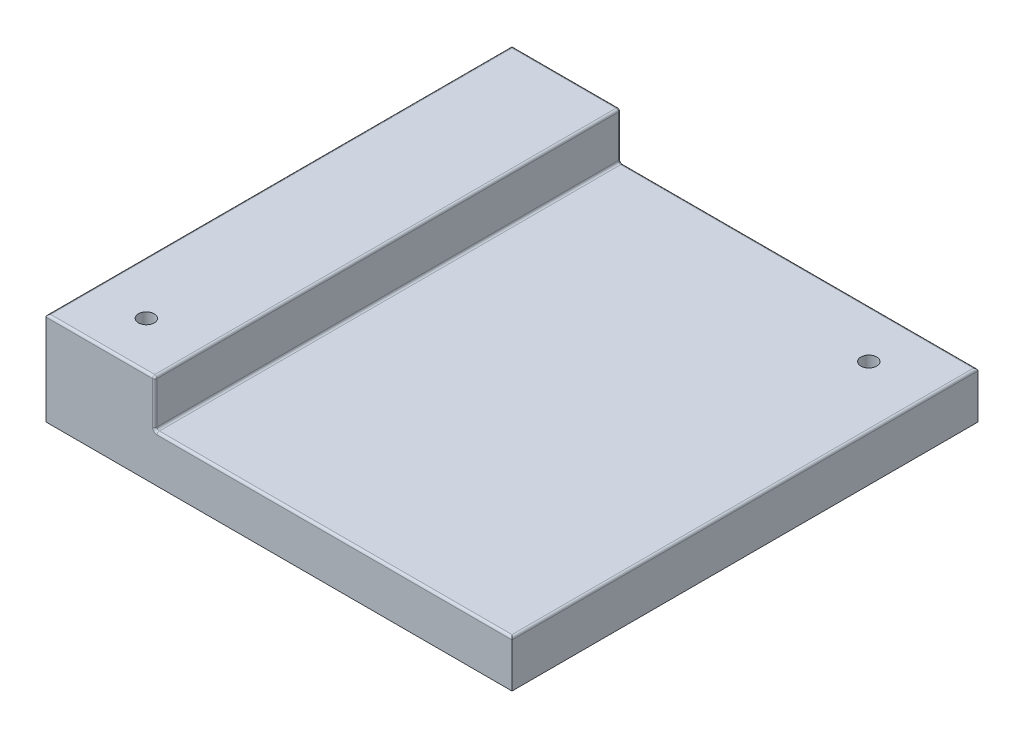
ISO-10303-21;
HEADER;
FILE_DESCRIPTION(('STEP AP214'),'2;1');
FILE_NAME('part.step','',(''),(''),'','','');
FILE_SCHEMA(('AUTOMOTIVE_DESIGN { 1 0 10303 214 1 1 1 1 }'));
ENDSEC;
DATA;
#1=APPLICATION_CONTEXT('core data for automotive mechanical design processes');
#2=APPLICATION_PROTOCOL_DEFINITION('international standard','automotive_design',2000,#1);
#3=PRODUCT_CONTEXT('',#1,'mechanical');
#4=PRODUCT('Part','Part','',(#3));
#5=PRODUCT_RELATED_PRODUCT_CATEGORY('part','',(#4));
#6=PRODUCT_DEFINITION_FORMATION('','',#4);
#7=PRODUCT_DEFINITION_CONTEXT('part definition',#1,'design');
#8=PRODUCT_DEFINITION('design','',#6,#7);
#9=PRODUCT_DEFINITION_SHAPE('','',#8);
#10=(LENGTH_UNIT() NAMED_UNIT(*) SI_UNIT(.MILLI.,.METRE.));
#11=(NAMED_UNIT(*) PLANE_ANGLE_UNIT() SI_UNIT($,.RADIAN.));
#12=(NAMED_UNIT(*) SI_UNIT($,.STERADIAN.) SOLID_ANGLE_UNIT());
#13=UNCERTAINTY_MEASURE_WITH_UNIT(LENGTH_MEASURE(1.E-05),#10,'distance_accuracy_value','');
#14=(GEOMETRIC_REPRESENTATION_CONTEXT(3) GLOBAL_UNCERTAINTY_ASSIGNED_CONTEXT((#13)) GLOBAL_UNIT_ASSIGNED_CONTEXT((#10,
#11,#12)) REPRESENTATION_CONTEXT('',''));
#15=CARTESIAN_POINT('',(0.,0.,0.));
#16=DIRECTION('',(0.,0.,1.));
#17=DIRECTION('',(1.,0.,0.));
#18=AXIS2_PLACEMENT_3D('',#15,#16,#17);
#19=CARTESIAN_POINT('',(1524.,0.,762.));
#20=DIRECTION('',(0.,1.,0.));
#21=DIRECTION('',(-1.,0.,0.));
#22=AXIS2_PLACEMENT_3D('',#19,#20,#21);
#23=PLANE('',#22);
#24=DIRECTION('',(1.,0.,0.));
#25=VECTOR('',#24,1.);
#26=CARTESIAN_POINT('',(1524.,0.,-762.));
#27=LINE('',#26,#25);
#28=CARTESIAN_POINT('',(0.,0.,-762.));
#29=VERTEX_POINT('',#28);
#30=CARTESIAN_POINT('',(1524.,0.,-762.));
#31=VERTEX_POINT('',#30);
#32=EDGE_CURVE('E248',#29,#31,#27,.T.);
#33=ORIENTED_EDGE('',*,*,#32,.T.);
#34=DIRECTION('',(0.,0.,-1.));
#35=VECTOR('',#34,1.);
#36=CARTESIAN_POINT('',(1524.,0.,762.));
#37=LINE('',#36,#35);
#38=CARTESIAN_POINT('',(1524.,0.,762.));
#39=VERTEX_POINT('',#38);
#40=EDGE_CURVE('E258',#39,#31,#37,.T.);
#41=ORIENTED_EDGE('',*,*,#40,.F.);
#42=DIRECTION('',(1.,0.,0.));
#43=VECTOR('',#42,1.);
#44=CARTESIAN_POINT('',(1524.,0.,762.));
#45=LINE('',#44,#43);
#46=CARTESIAN_POINT('',(0.,0.,762.));
#47=VERTEX_POINT('',#46);
#48=EDGE_CURVE('E238',#47,#39,#45,.T.);
#49=ORIENTED_EDGE('',*,*,#48,.F.);
#50=DIRECTION('',(0.,0.,-1.));
#51=VECTOR('',#50,1.);
#52=CARTESIAN_POINT('',(0.,0.,762.));
#53=LINE('',#52,#51);
#54=EDGE_CURVE('E247',#47,#29,#53,.T.);
#55=ORIENTED_EDGE('',*,*,#54,.T.);
#56=EDGE_LOOP('',(#33,#41,#49,#55));
#57=FACE_BOUND('',#56,.T.);
#58=DIRECTION('',(1.,0.,0.));
#59=VECTOR('',#58,1.);
#60=CARTESIAN_POINT('',(0.,0.,-723.9));
#61=LINE('',#60,#59);
#62=CARTESIAN_POINT('',(38.1,0.,-723.9));
#63=VERTEX_POINT('',#62);
#64=CARTESIAN_POINT('',(1485.9,0.,-723.9));
#65=VERTEX_POINT('',#64);
#66=EDGE_CURVE('E191',#63,#65,#61,.T.);
#67=ORIENTED_EDGE('',*,*,#66,.F.);
#68=DIRECTION('',(0.,0.,-1.));
#69=VECTOR('',#68,1.);
#70=CARTESIAN_POINT('',(38.1,0.,762.));
#71=LINE('',#70,#69);
#72=CARTESIAN_POINT('',(38.1,0.,723.9));
#73=VERTEX_POINT('',#72);
#74=EDGE_CURVE('E218',#73,#63,#71,.T.);
#75=ORIENTED_EDGE('',*,*,#74,.F.);
#76=DIRECTION('',(1.,0.,0.));
#77=VECTOR('',#76,1.);
#78=CARTESIAN_POINT('',(0.,0.,723.9));
#79=LINE('',#78,#77);
#80=CARTESIAN_POINT('',(1485.9,0.,723.9));
#81=VERTEX_POINT('',#80);
#82=EDGE_CURVE('E47',#73,#81,#79,.T.);
#83=ORIENTED_EDGE('',*,*,#82,.T.);
#84=DIRECTION('',(0.,0.,-1.));
#85=VECTOR('',#84,1.);
#86=CARTESIAN_POINT('',(1485.9,0.,762.));
#87=LINE('',#86,#85);
#88=EDGE_CURVE('E209',#81,#65,#87,.T.);
#89=ORIENTED_EDGE('',*,*,#88,.T.);
#90=EDGE_LOOP('',(#67,#75,#83,#89));
#91=FACE_BOUND('',#90,.T.);
#92=ADVANCED_FACE('F30',(#57,#91),#23,.F.);
#93=CARTESIAN_POINT('',(1524.,152.4,762.));
#94=DIRECTION('',(-1.,0.,0.));
#95=DIRECTION('',(0.,0.,1.));
#96=AXIS2_PLACEMENT_3D('',#93,#94,#95);
#97=PLANE('',#96);
#98=DIRECTION('',(0.,1.,0.));
#99=VECTOR('',#98,1.);
#100=CARTESIAN_POINT('',(1524.,152.4,-762.));
#101=LINE('',#100,#99);
#102=CARTESIAN_POINT('',(1524.,144.78,-762.));
#103=VERTEX_POINT('',#102);
#104=EDGE_CURVE('E251',#31,#103,#101,.T.);
#105=ORIENTED_EDGE('',*,*,#104,.T.);
#106=DIRECTION('',(0.,0.,-1.));
#107=VECTOR('',#106,1.);
#108=CARTESIAN_POINT('',(1524.,144.78,762.));
#109=LINE('',#108,#107);
#110=CARTESIAN_POINT('',(1524.,144.78,762.));
#111=VERTEX_POINT('',#110);
#112=EDGE_CURVE('E270',#103,#111,#109,.F.);
#113=ORIENTED_EDGE('',*,*,#112,.T.);
#114=DIRECTION('',(0.,1.,0.));
#115=VECTOR('',#114,1.);
#116=CARTESIAN_POINT('',(1524.,152.4,762.));
#117=LINE('',#116,#115);
#118=EDGE_CURVE('E241',#39,#111,#117,.T.);
#119=ORIENTED_EDGE('',*,*,#118,.F.);
#120=ORIENTED_EDGE('',*,*,#40,.T.);
#121=EDGE_LOOP('',(#105,#113,#119,#120));
#122=FACE_BOUND('',#121,.T.);
#123=ADVANCED_FACE('F376',(#122),#97,.F.);
#124=CARTESIAN_POINT('',(355.6,152.4,762.));
#125=DIRECTION('',(0.,-1.,0.));
#126=DIRECTION('',(0.,0.,-1.));
#127=AXIS2_PLACEMENT_3D('',#124,#125,#126);
#128=PLANE('',#127);
#129=CARTESIAN_POINT('',(1326.49600251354,152.4,-602.31280623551));
#130=DIRECTION('',(0.,-1.,0.));
#131=DIRECTION('',(0.,0.,-1.));
#132=AXIS2_PLACEMENT_3D('',#129,#130,#131);
#133=CIRCLE('',#132,25.8977072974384);
#134=CARTESIAN_POINT('',(1326.49600251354,152.4,-576.415098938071));
#135=VERTEX_POINT('',#134);
#136=EDGE_CURVE('E351',#135,#135,#133,.T.);
#137=ORIENTED_EDGE('',*,*,#136,.T.);
#138=EDGE_LOOP('',(#137));
#139=FACE_BOUND('',#138,.T.);
#140=DIRECTION('',(-1.,0.,0.));
#141=VECTOR('',#140,1.);
#142=CARTESIAN_POINT('',(355.6,152.4,754.38));
#143=LINE('',#142,#141);
#144=CARTESIAN_POINT('',(363.22,152.4,754.38));
#145=VERTEX_POINT('',#144);
#146=CARTESIAN_POINT('',(1516.38,152.4,754.38));
#147=VERTEX_POINT('',#146);
#148=EDGE_CURVE('E265',#145,#147,#143,.F.);
#149=ORIENTED_EDGE('',*,*,#148,.T.);
#150=DIRECTION('',(0.,0.,-1.));
#151=VECTOR('',#150,1.);
#152=CARTESIAN_POINT('',(1516.38,152.4,762.));
#153=LINE('',#152,#151);
#154=CARTESIAN_POINT('',(1516.38,152.4,-754.38));
#155=VERTEX_POINT('',#154);
#156=EDGE_CURVE('E267',#147,#155,#153,.T.);
#157=ORIENTED_EDGE('',*,*,#156,.T.);
#158=DIRECTION('',(-1.,0.,0.));
#159=VECTOR('',#158,1.);
#160=CARTESIAN_POINT('',(355.6,152.4,-754.38));
#161=LINE('',#160,#159);
#162=CARTESIAN_POINT('',(363.22,152.4,-754.38));
#163=VERTEX_POINT('',#162);
#164=EDGE_CURVE('E263',#155,#163,#161,.T.);
#165=ORIENTED_EDGE('',*,*,#164,.T.);
#166=DIRECTION('',(0.,0.,-1.));
#167=VECTOR('',#166,1.);
#168=CARTESIAN_POINT('',(363.22,152.4,762.));
#169=LINE('',#168,#167);
#170=EDGE_CURVE('E261',#163,#145,#169,.F.);
#171=ORIENTED_EDGE('',*,*,#170,.T.);
#172=EDGE_LOOP('',(#149,#157,#165,#171));
#173=FACE_BOUND('',#172,.T.);
#174=ADVANCED_FACE('F382',(#139,#173),#128,.F.);
#175=CARTESIAN_POINT('',(355.6,304.8,762.));
#176=DIRECTION('',(-1.,0.,0.));
#177=DIRECTION('',(0.,0.,1.));
#178=AXIS2_PLACEMENT_3D('',#175,#176,#177);
#179=PLANE('',#178);
#180=DIRECTION('',(0.,1.,0.));
#181=VECTOR('',#180,1.);
#182=CARTESIAN_POINT('',(355.6,304.8,754.38));
#183=LINE('',#182,#181);
#184=CARTESIAN_POINT('',(355.6,297.18,754.38));
#185=VERTEX_POINT('',#184);
#186=CARTESIAN_POINT('',(355.6,160.02,754.38));
#187=VERTEX_POINT('',#186);
#188=EDGE_CURVE('E295',#185,#187,#183,.F.);
#189=ORIENTED_EDGE('',*,*,#188,.T.);
#190=DIRECTION('',(0.,0.,-1.));
#191=VECTOR('',#190,1.);
#192=CARTESIAN_POINT('',(355.6,160.02,-762.));
#193=LINE('',#192,#191);
#194=CARTESIAN_POINT('',(355.6,160.02,-754.38));
#195=VERTEX_POINT('',#194);
#196=EDGE_CURVE('E297',#187,#195,#193,.T.);
#197=ORIENTED_EDGE('',*,*,#196,.T.);
#198=DIRECTION('',(0.,1.,0.));
#199=VECTOR('',#198,1.);
#200=CARTESIAN_POINT('',(355.6,304.8,-754.38));
#201=LINE('',#200,#199);
#202=CARTESIAN_POINT('',(355.6,297.18,-754.38));
#203=VERTEX_POINT('',#202);
#204=EDGE_CURVE('E293',#195,#203,#201,.T.);
#205=ORIENTED_EDGE('',*,*,#204,.T.);
#206=DIRECTION('',(0.,0.,-1.));
#207=VECTOR('',#206,1.);
#208=CARTESIAN_POINT('',(355.6,297.18,762.));
#209=LINE('',#208,#207);
#210=EDGE_CURVE('E291',#203,#185,#209,.F.);
#211=ORIENTED_EDGE('',*,*,#210,.T.);
#212=EDGE_LOOP('',(#189,#197,#205,#211));
#213=FACE_BOUND('',#212,.T.);
#214=ADVANCED_FACE('F473',(#213),#179,.F.);
#215=CARTESIAN_POINT('',(0.,304.8,762.));
#216=DIRECTION('',(0.,-1.,0.));
#217=DIRECTION('',(0.,0.,-1.));
#218=AXIS2_PLACEMENT_3D('',#215,#216,#217);
#219=PLANE('',#218);
#220=CARTESIAN_POINT('',(175.248210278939,304.8,609.021753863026));
#221=DIRECTION('',(0.,1.,0.));
#222=DIRECTION('',(0.,0.,1.));
#223=AXIS2_PLACEMENT_3D('',#220,#221,#222);
#224=CIRCLE('',#223,25.8977072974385);
#225=CARTESIAN_POINT('',(175.248210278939,304.8,634.919461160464));
#226=VERTEX_POINT('',#225);
#227=EDGE_CURVE('E199',#226,#226,#224,.T.);
#228=ORIENTED_EDGE('',*,*,#227,.F.);
#229=EDGE_LOOP('',(#228));
#230=FACE_BOUND('',#229,.T.);
#231=DIRECTION('',(-1.,0.,0.));
#232=VECTOR('',#231,1.);
#233=CARTESIAN_POINT('',(0.,304.8,754.38));
#234=LINE('',#233,#232);
#235=CARTESIAN_POINT('',(7.62,304.8,754.38));
#236=VERTEX_POINT('',#235);
#237=CARTESIAN_POINT('',(347.98,304.8,754.38));
#238=VERTEX_POINT('',#237);
#239=EDGE_CURVE('E55',#236,#238,#234,.F.);
#240=ORIENTED_EDGE('',*,*,#239,.T.);
#241=DIRECTION('',(0.,0.,-1.));
#242=VECTOR('',#241,1.);
#243=CARTESIAN_POINT('',(347.98,304.8,762.));
#244=LINE('',#243,#242);
#245=CARTESIAN_POINT('',(347.98,304.8,-754.38));
#246=VERTEX_POINT('',#245);
#247=EDGE_CURVE('E39',#238,#246,#244,.T.);
#248=ORIENTED_EDGE('',*,*,#247,.T.);
#249=DIRECTION('',(-1.,0.,0.));
#250=VECTOR('',#249,1.);
#251=CARTESIAN_POINT('',(0.,304.8,-754.38));
#252=LINE('',#251,#250);
#253=CARTESIAN_POINT('',(7.62,304.8,-754.38));
#254=VERTEX_POINT('',#253);
#255=EDGE_CURVE('E300',#246,#254,#252,.T.);
#256=ORIENTED_EDGE('',*,*,#255,.T.);
#257=DIRECTION('',(0.,0.,-1.));
#258=VECTOR('',#257,1.);
#259=CARTESIAN_POINT('',(7.62,304.8,762.));
#260=LINE('',#259,#258);
#261=EDGE_CURVE('E302',#254,#236,#260,.F.);
#262=ORIENTED_EDGE('',*,*,#261,.T.);
#263=EDGE_LOOP('',(#240,#248,#256,#262));
#264=FACE_BOUND('',#263,.T.);
#265=ADVANCED_FACE('F478',(#230,#264),#219,.F.);
#266=CARTESIAN_POINT('',(0.,0.,762.));
#267=DIRECTION('',(1.,0.,0.));
#268=DIRECTION('',(0.,0.,-1.));
#269=AXIS2_PLACEMENT_3D('',#266,#267,#268);
#270=PLANE('',#269);
#271=DIRECTION('',(0.,-1.,0.));
#272=VECTOR('',#271,1.);
#273=CARTESIAN_POINT('',(0.,0.,762.));
#274=LINE('',#273,#272);
#275=CARTESIAN_POINT('',(0.,297.18,762.));
#276=VERTEX_POINT('',#275);
#277=EDGE_CURVE('E245',#276,#47,#274,.T.);
#278=ORIENTED_EDGE('',*,*,#277,.F.);
#279=DIRECTION('',(0.,0.,-1.));
#280=VECTOR('',#279,1.);
#281=CARTESIAN_POINT('',(0.,297.18,762.));
#282=LINE('',#281,#280);
#283=CARTESIAN_POINT('',(0.,297.18,-762.));
#284=VERTEX_POINT('',#283);
#285=EDGE_CURVE('E11',#276,#284,#282,.T.);
#286=ORIENTED_EDGE('',*,*,#285,.T.);
#287=DIRECTION('',(0.,-1.,0.));
#288=VECTOR('',#287,1.);
#289=CARTESIAN_POINT('',(0.,0.,-762.));
#290=LINE('',#289,#288);
#291=EDGE_CURVE('E242',#284,#29,#290,.T.);
#292=ORIENTED_EDGE('',*,*,#291,.T.);
#293=ORIENTED_EDGE('',*,*,#54,.F.);
#294=EDGE_LOOP('',(#278,#286,#292,#293));
#295=FACE_BOUND('',#294,.T.);
#296=ADVANCED_FACE('F452',(#295),#270,.F.);
#297=CARTESIAN_POINT('',(0.,0.,762.));
#298=DIRECTION('',(0.,0.,-1.));
#299=DIRECTION('',(-1.,0.,0.));
#300=AXIS2_PLACEMENT_3D('',#297,#298,#299);
#301=PLANE('',#300);
#302=ORIENTED_EDGE('',*,*,#118,.T.);
#303=DIRECTION('',(-1.,0.,0.));
#304=VECTOR('',#303,1.);
#305=CARTESIAN_POINT('',(0.,144.78,762.));
#306=LINE('',#305,#304);
#307=CARTESIAN_POINT('',(363.22,144.78,762.));
#308=VERTEX_POINT('',#307);
#309=EDGE_CURVE('E280',#111,#308,#306,.T.);
#310=ORIENTED_EDGE('',*,*,#309,.T.);
#311=CARTESIAN_POINT('',(363.22,160.02,762.));
#312=DIRECTION('',(0.,0.,-1.));
#313=DIRECTION('',(-1.,0.,0.));
#314=AXIS2_PLACEMENT_3D('',#311,#312,#313);
#315=CIRCLE('',#314,15.24);
#316=CARTESIAN_POINT('',(347.98,160.02,762.));
#317=VERTEX_POINT('',#316);
#318=EDGE_CURVE('E277',#317,#308,#315,.F.);
#319=ORIENTED_EDGE('',*,*,#318,.F.);
#320=DIRECTION('',(0.,1.,0.));
#321=VECTOR('',#320,1.);
#322=CARTESIAN_POINT('',(347.98,0.,762.));
#323=LINE('',#322,#321);
#324=CARTESIAN_POINT('',(347.98,297.18,762.));
#325=VERTEX_POINT('',#324);
#326=EDGE_CURVE('E275',#317,#325,#323,.T.);
#327=ORIENTED_EDGE('',*,*,#326,.T.);
#328=DIRECTION('',(-1.,0.,0.));
#329=VECTOR('',#328,1.);
#330=CARTESIAN_POINT('',(0.,297.18,762.));
#331=LINE('',#330,#329);
#332=EDGE_CURVE('E273',#325,#276,#331,.T.);
#333=ORIENTED_EDGE('',*,*,#332,.T.);
#334=ORIENTED_EDGE('',*,*,#277,.T.);
#335=ORIENTED_EDGE('',*,*,#48,.T.);
#336=EDGE_LOOP('',(#302,#310,#319,#327,#333,#334,#335));
#337=FACE_BOUND('',#336,.T.);
#338=ADVANCED_FACE('F460',(#337),#301,.F.);
#339=CARTESIAN_POINT('',(0.,0.,-762.));
#340=DIRECTION('',(0.,0.,-1.));
#341=DIRECTION('',(-1.,0.,0.));
#342=AXIS2_PLACEMENT_3D('',#339,#340,#341);
#343=PLANE('',#342);
#344=CARTESIAN_POINT('',(363.22,160.02,-762.));
#345=DIRECTION('',(0.,0.,-1.));
#346=DIRECTION('',(-1.,0.,0.));
#347=AXIS2_PLACEMENT_3D('',#344,#345,#346);
#348=CIRCLE('',#347,15.24);
#349=CARTESIAN_POINT('',(363.22,144.78,-762.));
#350=VERTEX_POINT('',#349);
#351=CARTESIAN_POINT('',(347.98,160.02,-762.));
#352=VERTEX_POINT('',#351);
#353=EDGE_CURVE('E286',#350,#352,#348,.T.);
#354=ORIENTED_EDGE('',*,*,#353,.F.);
#355=DIRECTION('',(-1.,0.,0.));
#356=VECTOR('',#355,1.);
#357=CARTESIAN_POINT('',(1524.,144.78,-762.));
#358=LINE('',#357,#356);
#359=EDGE_CURVE('E289',#350,#103,#358,.F.);
#360=ORIENTED_EDGE('',*,*,#359,.T.);
#361=ORIENTED_EDGE('',*,*,#104,.F.);
#362=ORIENTED_EDGE('',*,*,#32,.F.);
#363=ORIENTED_EDGE('',*,*,#291,.F.);
#364=DIRECTION('',(-1.,0.,0.));
#365=VECTOR('',#364,1.);
#366=CARTESIAN_POINT('',(355.6,297.18,-762.));
#367=LINE('',#366,#365);
#368=CARTESIAN_POINT('',(347.98,297.18,-762.));
#369=VERTEX_POINT('',#368);
#370=EDGE_CURVE('E282',#284,#369,#367,.F.);
#371=ORIENTED_EDGE('',*,*,#370,.T.);
#372=DIRECTION('',(0.,1.,0.));
#373=VECTOR('',#372,1.);
#374=CARTESIAN_POINT('',(347.98,152.4,-762.));
#375=LINE('',#374,#373);
#376=EDGE_CURVE('E284',#369,#352,#375,.F.);
#377=ORIENTED_EDGE('',*,*,#376,.T.);
#378=EDGE_LOOP('',(#354,#360,#361,#362,#363,#371,#377));
#379=FACE_BOUND('',#378,.T.);
#380=ADVANCED_FACE('F440',(#379),#343,.T.);
#381=CARTESIAN_POINT('',(7.62,297.18,762.));
#382=DIRECTION('',(0.,0.,-1.));
#383=DIRECTION('',(-1.,0.,0.));
#384=AXIS2_PLACEMENT_3D('',#381,#382,#383);
#385=CYLINDRICAL_SURFACE('',#384,7.62);
#386=CARTESIAN_POINT('',(7.62,297.18,-754.38));
#387=DIRECTION('',(0.707106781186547,0.,-0.707106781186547));
#388=DIRECTION('',(0.707106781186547,0.,0.707106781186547));
#389=AXIS2_PLACEMENT_3D('',#386,#387,#388);
#390=ELLIPSE('',#389,10.776307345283,7.62);
#391=EDGE_CURVE('E343',#284,#254,#390,.T.);
#392=ORIENTED_EDGE('',*,*,#391,.F.);
#393=ORIENTED_EDGE('',*,*,#285,.F.);
#394=CARTESIAN_POINT('',(7.62,297.18,754.38));
#395=DIRECTION('',(-0.707106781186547,0.,-0.707106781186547));
#396=DIRECTION('',(0.707106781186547,0.,-0.707106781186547));
#397=AXIS2_PLACEMENT_3D('',#394,#395,#396);
#398=ELLIPSE('',#397,10.776307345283,7.62);
#399=EDGE_CURVE('E252',#236,#276,#398,.F.);
#400=ORIENTED_EDGE('',*,*,#399,.F.);
#401=ORIENTED_EDGE('',*,*,#261,.F.);
#402=EDGE_LOOP('',(#392,#393,#400,#401));
#403=FACE_BOUND('',#402,.T.);
#404=ADVANCED_FACE('F32',(#403),#385,.T.);
#405=CARTESIAN_POINT('',(0.,297.18,754.38));
#406=DIRECTION('',(-1.,0.,0.));
#407=DIRECTION('',(0.,0.,1.));
#408=AXIS2_PLACEMENT_3D('',#405,#406,#407);
#409=CYLINDRICAL_SURFACE('',#408,7.62);
#410=ORIENTED_EDGE('',*,*,#399,.T.);
#411=ORIENTED_EDGE('',*,*,#332,.F.);
#412=CARTESIAN_POINT('',(347.98,297.18,754.38));
#413=DIRECTION('',(1.,0.,0.));
#414=DIRECTION('',(0.,0.,-1.));
#415=AXIS2_PLACEMENT_3D('',#412,#413,#414);
#416=CIRCLE('',#415,7.62);
#417=EDGE_CURVE('E340',#238,#325,#416,.T.);
#418=ORIENTED_EDGE('',*,*,#417,.F.);
#419=ORIENTED_EDGE('',*,*,#239,.F.);
#420=EDGE_LOOP('',(#410,#411,#418,#419));
#421=FACE_BOUND('',#420,.T.);
#422=ADVANCED_FACE('F433',(#421),#409,.T.);
#423=CARTESIAN_POINT('',(347.98,297.18,762.));
#424=DIRECTION('',(0.,0.,-1.));
#425=DIRECTION('',(-1.,0.,0.));
#426=AXIS2_PLACEMENT_3D('',#423,#424,#425);
#427=CYLINDRICAL_SURFACE('',#426,7.62);
#428=CARTESIAN_POINT('',(347.98,297.18,-754.38));
#429=DIRECTION('',(0.,0.,-1.));
#430=DIRECTION('',(-1.,0.,0.));
#431=AXIS2_PLACEMENT_3D('',#428,#429,#430);
#432=CIRCLE('',#431,7.62);
#433=EDGE_CURVE('E334',#246,#203,#432,.T.);
#434=ORIENTED_EDGE('',*,*,#433,.F.);
#435=ORIENTED_EDGE('',*,*,#247,.F.);
#436=CARTESIAN_POINT('',(347.98,297.18,754.38));
#437=DIRECTION('',(0.,0.,1.));
#438=DIRECTION('',(1.,0.,0.));
#439=AXIS2_PLACEMENT_3D('',#436,#437,#438);
#440=CIRCLE('',#439,7.62);
#441=EDGE_CURVE('E337',#185,#238,#440,.T.);
#442=ORIENTED_EDGE('',*,*,#441,.F.);
#443=ORIENTED_EDGE('',*,*,#210,.F.);
#444=EDGE_LOOP('',(#434,#435,#442,#443));
#445=FACE_BOUND('',#444,.T.);
#446=ADVANCED_FACE('F430',(#445),#427,.T.);
#447=CARTESIAN_POINT('',(0.,297.18,-754.38));
#448=DIRECTION('',(1.,0.,0.));
#449=DIRECTION('',(0.,0.,-1.));
#450=AXIS2_PLACEMENT_3D('',#447,#448,#449);
#451=CYLINDRICAL_SURFACE('',#450,7.62);
#452=ORIENTED_EDGE('',*,*,#391,.T.);
#453=ORIENTED_EDGE('',*,*,#255,.F.);
#454=CARTESIAN_POINT('',(347.98,297.18,-754.38));
#455=DIRECTION('',(1.,0.,0.));
#456=DIRECTION('',(0.,0.,-1.));
#457=AXIS2_PLACEMENT_3D('',#454,#455,#456);
#458=CIRCLE('',#457,7.62);
#459=EDGE_CURVE('E332',#369,#246,#458,.T.);
#460=ORIENTED_EDGE('',*,*,#459,.F.);
#461=ORIENTED_EDGE('',*,*,#370,.F.);
#462=EDGE_LOOP('',(#452,#453,#460,#461));
#463=FACE_BOUND('',#462,.T.);
#464=ADVANCED_FACE('F426',(#463),#451,.T.);
#465=CARTESIAN_POINT('',(347.98,297.18,754.38));
#466=DIRECTION('',(0.,0.,1.));
#467=DIRECTION('',(1.,0.,0.));
#468=AXIS2_PLACEMENT_3D('',#465,#466,#467);
#469=SPHERICAL_SURFACE('',#468,7.62);
#470=ORIENTED_EDGE('',*,*,#441,.T.);
#471=ORIENTED_EDGE('',*,*,#417,.T.);
#472=CARTESIAN_POINT('',(347.98,297.18,754.38));
#473=DIRECTION('',(0.,1.,0.));
#474=DIRECTION('',(0.,0.,1.));
#475=AXIS2_PLACEMENT_3D('',#472,#473,#474);
#476=CIRCLE('',#475,7.62);
#477=EDGE_CURVE('E329',#185,#325,#476,.F.);
#478=ORIENTED_EDGE('',*,*,#477,.F.);
#479=EDGE_LOOP('',(#470,#471,#478));
#480=FACE_BOUND('',#479,.T.);
#481=ADVANCED_FACE('F422',(#480),#469,.T.);
#482=CARTESIAN_POINT('',(347.98,297.18,-754.38));
#483=DIRECTION('',(0.,0.,1.));
#484=DIRECTION('',(1.,0.,0.));
#485=AXIS2_PLACEMENT_3D('',#482,#483,#484);
#486=SPHERICAL_SURFACE('',#485,7.62);
#487=ORIENTED_EDGE('',*,*,#459,.T.);
#488=ORIENTED_EDGE('',*,*,#433,.T.);
#489=CARTESIAN_POINT('',(347.98,297.18,-754.38));
#490=DIRECTION('',(0.,1.,0.));
#491=DIRECTION('',(0.,0.,1.));
#492=AXIS2_PLACEMENT_3D('',#489,#490,#491);
#493=CIRCLE('',#492,7.62);
#494=EDGE_CURVE('E326',#369,#203,#493,.F.);
#495=ORIENTED_EDGE('',*,*,#494,.F.);
#496=EDGE_LOOP('',(#487,#488,#495));
#497=FACE_BOUND('',#496,.T.);
#498=ADVANCED_FACE('F418',(#497),#486,.T.);
#499=CARTESIAN_POINT('',(347.98,0.,754.38));
#500=DIRECTION('',(0.,1.,0.));
#501=DIRECTION('',(0.,0.,1.));
#502=AXIS2_PLACEMENT_3D('',#499,#500,#501);
#503=CYLINDRICAL_SURFACE('',#502,7.62);
#504=ORIENTED_EDGE('',*,*,#477,.T.);
#505=ORIENTED_EDGE('',*,*,#326,.F.);
#506=CARTESIAN_POINT('',(347.98,160.02,754.38));
#507=DIRECTION('',(0.,-1.,0.));
#508=DIRECTION('',(0.,0.,-1.));
#509=AXIS2_PLACEMENT_3D('',#506,#507,#508);
#510=CIRCLE('',#509,7.62);
#511=EDGE_CURVE('E323',#187,#317,#510,.T.);
#512=ORIENTED_EDGE('',*,*,#511,.F.);
#513=ORIENTED_EDGE('',*,*,#188,.F.);
#514=EDGE_LOOP('',(#504,#505,#512,#513));
#515=FACE_BOUND('',#514,.T.);
#516=ADVANCED_FACE('F414',(#515),#503,.T.);
#517=CARTESIAN_POINT('',(363.22,160.02,762.));
#518=DIRECTION('',(0.,0.,1.));
#519=DIRECTION('',(1.,0.,0.));
#520=AXIS2_PLACEMENT_3D('',#517,#518,#519);
#521=CYLINDRICAL_SURFACE('',#520,7.62);
#522=CARTESIAN_POINT('',(363.22,160.02,-754.38));
#523=DIRECTION('',(0.,0.,-1.));
#524=DIRECTION('',(-1.,0.,0.));
#525=AXIS2_PLACEMENT_3D('',#522,#523,#524);
#526=CIRCLE('',#525,7.62);
#527=EDGE_CURVE('E317',#195,#163,#526,.F.);
#528=ORIENTED_EDGE('',*,*,#527,.F.);
#529=ORIENTED_EDGE('',*,*,#196,.F.);
#530=CARTESIAN_POINT('',(363.22,160.02,754.38));
#531=DIRECTION('',(0.,0.,-1.));
#532=DIRECTION('',(-1.,0.,0.));
#533=AXIS2_PLACEMENT_3D('',#530,#531,#532);
#534=CIRCLE('',#533,7.62);
#535=EDGE_CURVE('E320',#145,#187,#534,.T.);
#536=ORIENTED_EDGE('',*,*,#535,.F.);
#537=ORIENTED_EDGE('',*,*,#170,.F.);
#538=EDGE_LOOP('',(#528,#529,#536,#537));
#539=FACE_BOUND('',#538,.T.);
#540=ADVANCED_FACE('F410',(#539),#521,.F.);
#541=CARTESIAN_POINT('',(347.98,304.8,-754.38));
#542=DIRECTION('',(0.,-1.,0.));
#543=DIRECTION('',(0.,0.,-1.));
#544=AXIS2_PLACEMENT_3D('',#541,#542,#543);
#545=CYLINDRICAL_SURFACE('',#544,7.62);
#546=ORIENTED_EDGE('',*,*,#494,.T.);
#547=ORIENTED_EDGE('',*,*,#204,.F.);
#548=CARTESIAN_POINT('',(347.98,160.02,-754.38));
#549=DIRECTION('',(0.,-1.,0.));
#550=DIRECTION('',(0.,0.,-1.));
#551=AXIS2_PLACEMENT_3D('',#548,#549,#550);
#552=CIRCLE('',#551,7.62);
#553=EDGE_CURVE('E315',#352,#195,#552,.T.);
#554=ORIENTED_EDGE('',*,*,#553,.F.);
#555=ORIENTED_EDGE('',*,*,#376,.F.);
#556=EDGE_LOOP('',(#546,#547,#554,#555));
#557=FACE_BOUND('',#556,.T.);
#558=ADVANCED_FACE('F406',(#557),#545,.T.);
#559=CARTESIAN_POINT('',(363.22,160.02,754.38));
#560=DIRECTION('',(0.,0.,-1.));
#561=DIRECTION('',(-1.,0.,0.));
#562=AXIS2_PLACEMENT_3D('',#559,#560,#561);
#563=TOROIDAL_SURFACE('',#562,15.24,7.62);
#564=ORIENTED_EDGE('',*,*,#511,.T.);
#565=ORIENTED_EDGE('',*,*,#318,.T.);
#566=CARTESIAN_POINT('',(363.22,144.78,754.38));
#567=DIRECTION('',(-1.,0.,0.));
#568=DIRECTION('',(0.,0.,1.));
#569=AXIS2_PLACEMENT_3D('',#566,#567,#568);
#570=CIRCLE('',#569,7.62);
#571=EDGE_CURVE('E312',#145,#308,#570,.F.);
#572=ORIENTED_EDGE('',*,*,#571,.F.);
#573=ORIENTED_EDGE('',*,*,#535,.T.);
#574=EDGE_LOOP('',(#564,#565,#572,#573));
#575=FACE_BOUND('',#574,.T.);
#576=ADVANCED_FACE('F402',(#575),#563,.T.);
#577=CARTESIAN_POINT('',(363.22,160.02,-754.38));
#578=DIRECTION('',(0.,0.,-1.));
#579=DIRECTION('',(-1.,0.,0.));
#580=AXIS2_PLACEMENT_3D('',#577,#578,#579);
#581=TOROIDAL_SURFACE('',#580,15.24,7.62);
#582=ORIENTED_EDGE('',*,*,#553,.T.);
#583=ORIENTED_EDGE('',*,*,#527,.T.);
#584=CARTESIAN_POINT('',(363.22,144.78,-754.38));
#585=DIRECTION('',(-1.,0.,0.));
#586=DIRECTION('',(0.,0.,1.));
#587=AXIS2_PLACEMENT_3D('',#584,#585,#586);
#588=CIRCLE('',#587,7.62);
#589=EDGE_CURVE('E309',#350,#163,#588,.F.);
#590=ORIENTED_EDGE('',*,*,#589,.F.);
#591=ORIENTED_EDGE('',*,*,#353,.T.);
#592=EDGE_LOOP('',(#582,#583,#590,#591));
#593=FACE_BOUND('',#592,.T.);
#594=ADVANCED_FACE('F398',(#593),#581,.T.);
#595=CARTESIAN_POINT('',(0.,144.78,754.38));
#596=DIRECTION('',(-1.,0.,0.));
#597=DIRECTION('',(0.,0.,1.));
#598=AXIS2_PLACEMENT_3D('',#595,#596,#597);
#599=CYLINDRICAL_SURFACE('',#598,7.62);
#600=ORIENTED_EDGE('',*,*,#571,.T.);
#601=ORIENTED_EDGE('',*,*,#309,.F.);
#602=CARTESIAN_POINT('',(1516.38,144.78,754.38));
#603=DIRECTION('',(-0.707106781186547,0.,0.707106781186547));
#604=DIRECTION('',(-0.707106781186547,0.,-0.707106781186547));
#605=AXIS2_PLACEMENT_3D('',#602,#603,#604);
#606=ELLIPSE('',#605,10.776307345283,7.62);
#607=EDGE_CURVE('E307',#147,#111,#606,.F.);
#608=ORIENTED_EDGE('',*,*,#607,.F.);
#609=ORIENTED_EDGE('',*,*,#148,.F.);
#610=EDGE_LOOP('',(#600,#601,#608,#609));
#611=FACE_BOUND('',#610,.T.);
#612=ADVANCED_FACE('F394',(#611),#599,.T.);
#613=CARTESIAN_POINT('',(355.6,144.78,-754.38));
#614=DIRECTION('',(1.,0.,0.));
#615=DIRECTION('',(0.,0.,-1.));
#616=AXIS2_PLACEMENT_3D('',#613,#614,#615);
#617=CYLINDRICAL_SURFACE('',#616,7.62);
#618=ORIENTED_EDGE('',*,*,#589,.T.);
#619=ORIENTED_EDGE('',*,*,#164,.F.);
#620=CARTESIAN_POINT('',(1516.38,144.78,-754.38));
#621=DIRECTION('',(0.707106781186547,0.,0.707106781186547));
#622=DIRECTION('',(0.707106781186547,0.,-0.707106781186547));
#623=AXIS2_PLACEMENT_3D('',#620,#621,#622);
#624=ELLIPSE('',#623,10.776307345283,7.62);
#625=EDGE_CURVE('E230',#103,#155,#624,.T.);
#626=ORIENTED_EDGE('',*,*,#625,.F.);
#627=ORIENTED_EDGE('',*,*,#359,.F.);
#628=EDGE_LOOP('',(#618,#619,#626,#627));
#629=FACE_BOUND('',#628,.T.);
#630=ADVANCED_FACE('F390',(#629),#617,.T.);
#631=CARTESIAN_POINT('',(1516.38,144.78,762.));
#632=DIRECTION('',(0.,0.,-1.));
#633=DIRECTION('',(-1.,0.,0.));
#634=AXIS2_PLACEMENT_3D('',#631,#632,#633);
#635=CYLINDRICAL_SURFACE('',#634,7.62);
#636=ORIENTED_EDGE('',*,*,#607,.T.);
#637=ORIENTED_EDGE('',*,*,#112,.F.);
#638=ORIENTED_EDGE('',*,*,#625,.T.);
#639=ORIENTED_EDGE('',*,*,#156,.F.);
#640=EDGE_LOOP('',(#636,#637,#638,#639));
#641=FACE_BOUND('',#640,.T.);
#642=ADVANCED_FACE('F373',(#641),#635,.T.);
#643=CARTESIAN_POINT('',(1485.9,152.4,762.));
#644=DIRECTION('',(-1.,0.,0.));
#645=DIRECTION('',(0.,0.,1.));
#646=AXIS2_PLACEMENT_3D('',#643,#644,#645);
#647=PLANE('',#646);
#648=DIRECTION('',(0.,1.,0.));
#649=VECTOR('',#648,1.);
#650=CARTESIAN_POINT('',(1485.9,0.,-723.9));
#651=LINE('',#650,#649);
#652=CARTESIAN_POINT('',(1485.9,114.3,-723.9));
#653=VERTEX_POINT('',#652);
#654=EDGE_CURVE('E173',#65,#653,#651,.T.);
#655=ORIENTED_EDGE('',*,*,#654,.F.);
#656=ORIENTED_EDGE('',*,*,#88,.F.);
#657=DIRECTION('',(0.,1.,0.));
#658=VECTOR('',#657,1.);
#659=CARTESIAN_POINT('',(1485.9,0.,723.9));
#660=LINE('',#659,#658);
#661=CARTESIAN_POINT('',(1485.9,114.3,723.9));
#662=VERTEX_POINT('',#661);
#663=EDGE_CURVE('E175',#81,#662,#660,.T.);
#664=ORIENTED_EDGE('',*,*,#663,.T.);
#665=DIRECTION('',(0.,0.,1.));
#666=VECTOR('',#665,1.);
#667=CARTESIAN_POINT('',(1485.9,114.3,762.));
#668=LINE('',#667,#666);
#669=EDGE_CURVE('E168',#653,#662,#668,.T.);
#670=ORIENTED_EDGE('',*,*,#669,.F.);
#671=EDGE_LOOP('',(#655,#656,#664,#670));
#672=FACE_BOUND('',#671,.T.);
#673=ADVANCED_FACE('F170',(#672),#647,.T.);
#674=CARTESIAN_POINT('',(355.6,114.3,762.));
#675=DIRECTION('',(0.,-1.,0.));
#676=DIRECTION('',(0.,0.,-1.));
#677=AXIS2_PLACEMENT_3D('',#674,#675,#676);
#678=PLANE('',#677);
#679=CARTESIAN_POINT('',(1326.49600251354,114.3,-602.31280623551));
#680=DIRECTION('',(0.,-1.,0.));
#681=DIRECTION('',(0.,0.,-1.));
#682=AXIS2_PLACEMENT_3D('',#679,#680,#681);
#683=CIRCLE('',#682,25.8977072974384);
#684=CARTESIAN_POINT('',(1326.49600251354,114.3,-576.415098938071));
#685=VERTEX_POINT('',#684);
#686=EDGE_CURVE('E34',#685,#685,#683,.T.);
#687=ORIENTED_EDGE('',*,*,#686,.F.);
#688=EDGE_LOOP('',(#687));
#689=FACE_BOUND('',#688,.T.);
#690=DIRECTION('',(-1.,0.,0.));
#691=VECTOR('',#690,1.);
#692=CARTESIAN_POINT('',(0.,114.3,723.9));
#693=LINE('',#692,#691);
#694=CARTESIAN_POINT('',(363.22,114.3,723.9));
#695=VERTEX_POINT('',#694);
#696=EDGE_CURVE('E204',#662,#695,#693,.T.);
#697=ORIENTED_EDGE('',*,*,#696,.T.);
#698=DIRECTION('',(0.,0.,-1.));
#699=VECTOR('',#698,1.);
#700=CARTESIAN_POINT('',(363.22,114.3,762.));
#701=LINE('',#700,#699);
#702=CARTESIAN_POINT('',(363.22,114.3,-723.9));
#703=VERTEX_POINT('',#702);
#704=EDGE_CURVE('E184',#703,#695,#701,.F.);
#705=ORIENTED_EDGE('',*,*,#704,.F.);
#706=DIRECTION('',(-1.,0.,0.));
#707=VECTOR('',#706,1.);
#708=CARTESIAN_POINT('',(0.,114.3,-723.9));
#709=LINE('',#708,#707);
#710=EDGE_CURVE('E179',#653,#703,#709,.T.);
#711=ORIENTED_EDGE('',*,*,#710,.F.);
#712=ORIENTED_EDGE('',*,*,#669,.T.);
#713=EDGE_LOOP('',(#697,#705,#711,#712));
#714=FACE_BOUND('',#713,.T.);
#715=ADVANCED_FACE('F182',(#689,#714),#678,.T.);
#716=CARTESIAN_POINT('',(317.5,304.8,762.));
#717=DIRECTION('',(-1.,0.,0.));
#718=DIRECTION('',(0.,0.,1.));
#719=AXIS2_PLACEMENT_3D('',#716,#717,#718);
#720=PLANE('',#719);
#721=DIRECTION('',(0.,1.,0.));
#722=VECTOR('',#721,1.);
#723=CARTESIAN_POINT('',(317.5,0.,723.9));
#724=LINE('',#723,#722);
#725=CARTESIAN_POINT('',(317.5,160.02,723.9));
#726=VERTEX_POINT('',#725);
#727=CARTESIAN_POINT('',(317.5,266.7,723.9));
#728=VERTEX_POINT('',#727);
#729=EDGE_CURVE('E212',#726,#728,#724,.T.);
#730=ORIENTED_EDGE('',*,*,#729,.T.);
#731=DIRECTION('',(0.,0.,-1.));
#732=VECTOR('',#731,1.);
#733=CARTESIAN_POINT('',(317.5,266.7,762.));
#734=LINE('',#733,#732);
#735=CARTESIAN_POINT('',(317.5,266.7,-723.9));
#736=VERTEX_POINT('',#735);
#737=EDGE_CURVE('E224',#728,#736,#734,.T.);
#738=ORIENTED_EDGE('',*,*,#737,.T.);
#739=DIRECTION('',(0.,1.,0.));
#740=VECTOR('',#739,1.);
#741=CARTESIAN_POINT('',(317.5,0.,-723.9));
#742=LINE('',#741,#740);
#743=CARTESIAN_POINT('',(317.5,160.02,-723.9));
#744=VERTEX_POINT('',#743);
#745=EDGE_CURVE('E205',#744,#736,#742,.T.);
#746=ORIENTED_EDGE('',*,*,#745,.F.);
#747=DIRECTION('',(0.,0.,1.));
#748=VECTOR('',#747,1.);
#749=CARTESIAN_POINT('',(317.5,160.02,762.));
#750=LINE('',#749,#748);
#751=EDGE_CURVE('E219',#726,#744,#750,.F.);
#752=ORIENTED_EDGE('',*,*,#751,.F.);
#753=EDGE_LOOP('',(#730,#738,#746,#752));
#754=FACE_BOUND('',#753,.T.);
#755=ADVANCED_FACE('F364',(#754),#720,.T.);
#756=CARTESIAN_POINT('',(0.,266.7,762.));
#757=DIRECTION('',(0.,-1.,0.));
#758=DIRECTION('',(0.,0.,-1.));
#759=AXIS2_PLACEMENT_3D('',#756,#757,#758);
#760=PLANE('',#759);
#761=CARTESIAN_POINT('',(175.248210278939,266.7,609.021753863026));
#762=DIRECTION('',(0.,-1.,0.));
#763=DIRECTION('',(0.,0.,-1.));
#764=AXIS2_PLACEMENT_3D('',#761,#762,#763);
#765=CIRCLE('',#764,25.8977072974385);
#766=CARTESIAN_POINT('',(175.248210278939,266.7,634.919461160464));
#767=VERTEX_POINT('',#766);
#768=EDGE_CURVE('E233',#767,#767,#765,.T.);
#769=ORIENTED_EDGE('',*,*,#768,.F.);
#770=EDGE_LOOP('',(#769));
#771=FACE_BOUND('',#770,.T.);
#772=DIRECTION('',(-1.,0.,0.));
#773=VECTOR('',#772,1.);
#774=CARTESIAN_POINT('',(0.,266.7,723.9));
#775=LINE('',#774,#773);
#776=CARTESIAN_POINT('',(38.1,266.7,723.9));
#777=VERTEX_POINT('',#776);
#778=EDGE_CURVE('E178',#728,#777,#775,.T.);
#779=ORIENTED_EDGE('',*,*,#778,.T.);
#780=DIRECTION('',(0.,0.,-1.));
#781=VECTOR('',#780,1.);
#782=CARTESIAN_POINT('',(38.1,266.7,762.));
#783=LINE('',#782,#781);
#784=CARTESIAN_POINT('',(38.1,266.7,-723.9));
#785=VERTEX_POINT('',#784);
#786=EDGE_CURVE('E227',#777,#785,#783,.T.);
#787=ORIENTED_EDGE('',*,*,#786,.T.);
#788=DIRECTION('',(-1.,0.,0.));
#789=VECTOR('',#788,1.);
#790=CARTESIAN_POINT('',(0.,266.7,-723.9));
#791=LINE('',#790,#789);
#792=EDGE_CURVE('E221',#736,#785,#791,.T.);
#793=ORIENTED_EDGE('',*,*,#792,.F.);
#794=ORIENTED_EDGE('',*,*,#737,.F.);
#795=EDGE_LOOP('',(#779,#787,#793,#794));
#796=FACE_BOUND('',#795,.T.);
#797=ADVANCED_FACE('F370',(#771,#796),#760,.T.);
#798=CARTESIAN_POINT('',(38.1,0.,762.));
#799=DIRECTION('',(1.,0.,0.));
#800=DIRECTION('',(0.,0.,-1.));
#801=AXIS2_PLACEMENT_3D('',#798,#799,#800);
#802=PLANE('',#801);
#803=DIRECTION('',(0.,-1.,0.));
#804=VECTOR('',#803,1.);
#805=CARTESIAN_POINT('',(38.1,0.,723.9));
#806=LINE('',#805,#804);
#807=EDGE_CURVE('E203',#777,#73,#806,.T.);
#808=ORIENTED_EDGE('',*,*,#807,.T.);
#809=ORIENTED_EDGE('',*,*,#74,.T.);
#810=DIRECTION('',(0.,-1.,0.));
#811=VECTOR('',#810,1.);
#812=CARTESIAN_POINT('',(38.1,0.,-723.9));
#813=LINE('',#812,#811);
#814=EDGE_CURVE('E193',#785,#63,#813,.T.);
#815=ORIENTED_EDGE('',*,*,#814,.F.);
#816=ORIENTED_EDGE('',*,*,#786,.F.);
#817=EDGE_LOOP('',(#808,#809,#815,#816));
#818=FACE_BOUND('',#817,.T.);
#819=ADVANCED_FACE('F516',(#818),#802,.T.);
#820=CARTESIAN_POINT('',(0.,0.,723.9));
#821=DIRECTION('',(0.,0.,-1.));
#822=DIRECTION('',(-1.,0.,0.));
#823=AXIS2_PLACEMENT_3D('',#820,#821,#822);
#824=PLANE('',#823);
#825=ORIENTED_EDGE('',*,*,#663,.F.);
#826=ORIENTED_EDGE('',*,*,#82,.F.);
#827=ORIENTED_EDGE('',*,*,#807,.F.);
#828=ORIENTED_EDGE('',*,*,#778,.F.);
#829=ORIENTED_EDGE('',*,*,#729,.F.);
#830=CARTESIAN_POINT('',(363.22,160.02,723.9));
#831=DIRECTION('',(0.,0.,-1.));
#832=DIRECTION('',(-1.,0.,0.));
#833=AXIS2_PLACEMENT_3D('',#830,#831,#832);
#834=CIRCLE('',#833,45.72);
#835=EDGE_CURVE('E206',#726,#695,#834,.F.);
#836=ORIENTED_EDGE('',*,*,#835,.T.);
#837=ORIENTED_EDGE('',*,*,#696,.F.);
#838=EDGE_LOOP('',(#825,#826,#827,#828,#829,#836,#837));
#839=FACE_BOUND('',#838,.T.);
#840=ADVANCED_FACE('F513',(#839),#824,.T.);
#841=CARTESIAN_POINT('',(0.,0.,-723.9));
#842=DIRECTION('',(0.,0.,-1.));
#843=DIRECTION('',(-1.,0.,0.));
#844=AXIS2_PLACEMENT_3D('',#841,#842,#843);
#845=PLANE('',#844);
#846=CARTESIAN_POINT('',(363.22,160.02,-723.9));
#847=DIRECTION('',(0.,0.,-1.));
#848=DIRECTION('',(-1.,0.,0.));
#849=AXIS2_PLACEMENT_3D('',#846,#847,#848);
#850=CIRCLE('',#849,45.72);
#851=EDGE_CURVE('E196',#744,#703,#850,.F.);
#852=ORIENTED_EDGE('',*,*,#851,.F.);
#853=ORIENTED_EDGE('',*,*,#745,.T.);
#854=ORIENTED_EDGE('',*,*,#792,.T.);
#855=ORIENTED_EDGE('',*,*,#814,.T.);
#856=ORIENTED_EDGE('',*,*,#66,.T.);
#857=ORIENTED_EDGE('',*,*,#654,.T.);
#858=ORIENTED_EDGE('',*,*,#710,.T.);
#859=EDGE_LOOP('',(#852,#853,#854,#855,#856,#857,#858));
#860=FACE_BOUND('',#859,.T.);
#861=ADVANCED_FACE('F189',(#860),#845,.F.);
#862=CARTESIAN_POINT('',(363.22,160.02,762.));
#863=DIRECTION('',(0.,0.,1.));
#864=DIRECTION('',(1.,0.,0.));
#865=AXIS2_PLACEMENT_3D('',#862,#863,#864);
#866=CYLINDRICAL_SURFACE('',#865,45.72);
#867=ORIENTED_EDGE('',*,*,#851,.T.);
#868=ORIENTED_EDGE('',*,*,#704,.T.);
#869=ORIENTED_EDGE('',*,*,#835,.F.);
#870=ORIENTED_EDGE('',*,*,#751,.T.);
#871=EDGE_LOOP('',(#867,#868,#869,#870));
#872=FACE_BOUND('',#871,.T.);
#873=ADVANCED_FACE('F506',(#872),#866,.T.);
#874=CARTESIAN_POINT('',(175.248210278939,0.,609.021753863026));
#875=DIRECTION('',(0.,1.,0.));
#876=DIRECTION('',(0.,0.,1.));
#877=AXIS2_PLACEMENT_3D('',#874,#875,#876);
#878=CYLINDRICAL_SURFACE('',#877,25.8977072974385);
#879=CARTESIAN_POINT('',(175.248210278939,266.7,634.919461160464));
#880=CARTESIAN_POINT('',(175.248210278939,267.096875,634.919461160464));
#881=CARTESIAN_POINT('',(175.248210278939,267.49375,634.919461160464));
#882=CARTESIAN_POINT('',(175.248210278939,268.2875,634.919461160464));
#883=CARTESIAN_POINT('',(175.248210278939,268.684375,634.919461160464));
#884=CARTESIAN_POINT('',(175.248210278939,269.478125,634.919461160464));
#885=CARTESIAN_POINT('',(175.248210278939,269.875,634.919461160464));
#886=CARTESIAN_POINT('',(175.248210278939,270.66875,634.919461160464));
#887=CARTESIAN_POINT('',(175.248210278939,271.065625,634.919461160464));
#888=CARTESIAN_POINT('',(175.248210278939,271.859375,634.919461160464));
#889=CARTESIAN_POINT('',(175.248210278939,272.25625,634.919461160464));
#890=CARTESIAN_POINT('',(175.248210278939,273.05,634.919461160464));
#891=CARTESIAN_POINT('',(175.248210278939,273.446875,634.919461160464));
#892=CARTESIAN_POINT('',(175.248210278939,274.240625,634.919461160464));
#893=CARTESIAN_POINT('',(175.248210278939,274.6375,634.919461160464));
#894=CARTESIAN_POINT('',(175.248210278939,275.43125,634.919461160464));
#895=CARTESIAN_POINT('',(175.248210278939,275.828125,634.919461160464));
#896=CARTESIAN_POINT('',(175.248210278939,276.621875,634.919461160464));
#897=CARTESIAN_POINT('',(175.248210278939,277.01875,634.919461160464));
#898=CARTESIAN_POINT('',(175.248210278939,277.8125,634.919461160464));
#899=CARTESIAN_POINT('',(175.248210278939,278.209375,634.919461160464));
#900=CARTESIAN_POINT('',(175.248210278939,279.003125,634.919461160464));
#901=CARTESIAN_POINT('',(175.248210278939,279.4,634.919461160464));
#902=CARTESIAN_POINT('',(175.248210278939,280.19375,634.919461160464));
#903=CARTESIAN_POINT('',(175.248210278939,280.590625,634.919461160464));
#904=CARTESIAN_POINT('',(175.248210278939,281.384375,634.919461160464));
#905=CARTESIAN_POINT('',(175.248210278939,281.78125,634.919461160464));
#906=CARTESIAN_POINT('',(175.248210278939,282.575,634.919461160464));
#907=CARTESIAN_POINT('',(175.248210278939,282.971875,634.919461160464));
#908=CARTESIAN_POINT('',(175.248210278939,283.765625,634.919461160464));
#909=CARTESIAN_POINT('',(175.248210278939,284.1625,634.919461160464));
#910=CARTESIAN_POINT('',(175.248210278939,284.95625,634.919461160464));
#911=CARTESIAN_POINT('',(175.248210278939,285.353125,634.919461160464));
#912=CARTESIAN_POINT('',(175.248210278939,286.146875,634.919461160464));
#913=CARTESIAN_POINT('',(175.248210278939,286.54375,634.919461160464));
#914=CARTESIAN_POINT('',(175.248210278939,287.3375,634.919461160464));
#915=CARTESIAN_POINT('',(175.248210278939,287.734375,634.919461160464));
#916=CARTESIAN_POINT('',(175.248210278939,288.528125,634.919461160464));
#917=CARTESIAN_POINT('',(175.248210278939,288.925,634.919461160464));
#918=CARTESIAN_POINT('',(175.248210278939,289.71875,634.919461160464));
#919=CARTESIAN_POINT('',(175.248210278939,290.115625,634.919461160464));
#920=CARTESIAN_POINT('',(175.248210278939,290.909375,634.919461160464));
#921=CARTESIAN_POINT('',(175.248210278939,291.30625,634.919461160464));
#922=CARTESIAN_POINT('',(175.248210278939,292.1,634.919461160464));
#923=CARTESIAN_POINT('',(175.248210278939,292.496875,634.919461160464));
#924=CARTESIAN_POINT('',(175.248210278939,293.290625,634.919461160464));
#925=CARTESIAN_POINT('',(175.248210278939,293.6875,634.919461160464));
#926=CARTESIAN_POINT('',(175.248210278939,294.48125,634.919461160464));
#927=CARTESIAN_POINT('',(175.248210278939,294.878125,634.919461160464));
#928=CARTESIAN_POINT('',(175.248210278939,295.671875,634.919461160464));
#929=CARTESIAN_POINT('',(175.248210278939,296.06875,634.919461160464));
#930=CARTESIAN_POINT('',(175.248210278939,296.8625,634.919461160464));
#931=CARTESIAN_POINT('',(175.248210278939,297.259375,634.919461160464));
#932=CARTESIAN_POINT('',(175.248210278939,298.053125,634.919461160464));
#933=CARTESIAN_POINT('',(175.248210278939,298.45,634.919461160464));
#934=CARTESIAN_POINT('',(175.248210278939,299.24375,634.919461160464));
#935=CARTESIAN_POINT('',(175.248210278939,299.640625,634.919461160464));
#936=CARTESIAN_POINT('',(175.248210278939,300.434375,634.919461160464));
#937=CARTESIAN_POINT('',(175.248210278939,300.83125,634.919461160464));
#938=CARTESIAN_POINT('',(175.248210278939,301.625,634.919461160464));
#939=CARTESIAN_POINT('',(175.248210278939,302.021875,634.919461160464));
#940=CARTESIAN_POINT('',(175.248210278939,302.815625,634.919461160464));
#941=CARTESIAN_POINT('',(175.248210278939,303.2125,634.919461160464));
#942=CARTESIAN_POINT('',(175.248210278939,304.00625,634.919461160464));
#943=CARTESIAN_POINT('',(175.248210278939,304.403125,634.919461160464));
#944=CARTESIAN_POINT('',(175.248210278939,304.8,634.919461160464));
#945=B_SPLINE_CURVE_WITH_KNOTS('',3,(#879,#880,#881,#882,#883,#884,#885,#886,#887,#888,#889,
#890,#891,#892,#893,#894,#895,#896,#897,#898,#899,#900,#901,#902,#903,#904,#905,#906,#907,#908,
#909,#910,#911,#912,#913,#914,#915,#916,#917,#918,#919,#920,#921,#922,#923,#924,#925,#926,#927,
#928,#929,#930,#931,#932,#933,#934,#935,#936,#937,#938,#939,#940,#941,#942,#943,#944),
.UNSPECIFIED.,.F.,.F.,(4,2,2,2,2,2,2,2,2,2,2,2,2,2,2,2,2,2,2,2,2,2,2,2,2,2,2,2,2,2,2,2,4),(0.,
1.190625,2.38125,3.571875,4.7625,5.953125,7.14375,8.334375,9.52500000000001,10.715625,11.90625,
13.096875,14.2875,15.478125,16.66875,17.859375,19.05,20.240625,21.43125,22.621875,23.8125,
25.003125,26.19375,27.384375,28.575,29.765625,30.95625,32.146875,33.3375,34.528125,35.71875,
36.909375,38.1),.UNSPECIFIED.);
#946=EDGE_CURVE('BSEAM509',#767,#226,#945,.T.);
#947=ORIENTED_EDGE('',*,*,#768,.T.);
#948=ORIENTED_EDGE('',*,*,#227,.T.);
#949=ORIENTED_EDGE('',*,*,#946,.T.);
#950=ORIENTED_EDGE('',*,*,#946,.F.);
#951=EDGE_LOOP('',(#947,#949,#948,#950));
#952=FACE_BOUND('',#951,.T.);
#953=ADVANCED_FACE('F509',(#952),#878,.F.);
#954=CARTESIAN_POINT('',(1326.49600251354,0.,-602.31280623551));
#955=DIRECTION('',(0.,1.,0.));
#956=DIRECTION('',(0.,0.,1.));
#957=AXIS2_PLACEMENT_3D('',#954,#955,#956);
#958=CYLINDRICAL_SURFACE('',#957,25.8977072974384);
#959=CARTESIAN_POINT('',(1326.49600251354,114.3,-576.415098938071));
#960=CARTESIAN_POINT('',(1326.49600251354,114.696875,-576.415098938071));
#961=CARTESIAN_POINT('',(1326.49600251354,115.09375,-576.415098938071));
#962=CARTESIAN_POINT('',(1326.49600251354,115.8875,-576.415098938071));
#963=CARTESIAN_POINT('',(1326.49600251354,116.284375,-576.415098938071));
#964=CARTESIAN_POINT('',(1326.49600251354,117.078125,-576.415098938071));
#965=CARTESIAN_POINT('',(1326.49600251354,117.475,-576.415098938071));
#966=CARTESIAN_POINT('',(1326.49600251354,118.26875,-576.415098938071));
#967=CARTESIAN_POINT('',(1326.49600251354,118.665625,-576.415098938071));
#968=CARTESIAN_POINT('',(1326.49600251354,119.459375,-576.415098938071));
#969=CARTESIAN_POINT('',(1326.49600251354,119.85625,-576.415098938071));
#970=CARTESIAN_POINT('',(1326.49600251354,120.65,-576.415098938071));
#971=CARTESIAN_POINT('',(1326.49600251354,121.046875,-576.415098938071));
#972=CARTESIAN_POINT('',(1326.49600251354,121.840625,-576.415098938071));
#973=CARTESIAN_POINT('',(1326.49600251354,122.2375,-576.415098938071));
#974=CARTESIAN_POINT('',(1326.49600251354,123.03125,-576.415098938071));
#975=CARTESIAN_POINT('',(1326.49600251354,123.428125,-576.415098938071));
#976=CARTESIAN_POINT('',(1326.49600251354,124.221875,-576.415098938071));
#977=CARTESIAN_POINT('',(1326.49600251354,124.61875,-576.415098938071));
#978=CARTESIAN_POINT('',(1326.49600251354,125.4125,-576.415098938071));
#979=CARTESIAN_POINT('',(1326.49600251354,125.809375,-576.415098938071));
#980=CARTESIAN_POINT('',(1326.49600251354,126.603125,-576.415098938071));
#981=CARTESIAN_POINT('',(1326.49600251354,127.,-576.415098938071));
#982=CARTESIAN_POINT('',(1326.49600251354,127.79375,-576.415098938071));
#983=CARTESIAN_POINT('',(1326.49600251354,128.190625,-576.415098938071));
#984=CARTESIAN_POINT('',(1326.49600251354,128.984375,-576.415098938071));
#985=CARTESIAN_POINT('',(1326.49600251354,129.38125,-576.415098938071));
#986=CARTESIAN_POINT('',(1326.49600251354,130.175,-576.415098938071));
#987=CARTESIAN_POINT('',(1326.49600251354,130.571875,-576.415098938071));
#988=CARTESIAN_POINT('',(1326.49600251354,131.365625,-576.415098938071));
#989=CARTESIAN_POINT('',(1326.49600251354,131.7625,-576.415098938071));
#990=CARTESIAN_POINT('',(1326.49600251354,132.55625,-576.415098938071));
#991=CARTESIAN_POINT('',(1326.49600251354,132.953125,-576.415098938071));
#992=CARTESIAN_POINT('',(1326.49600251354,133.746875,-576.415098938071));
#993=CARTESIAN_POINT('',(1326.49600251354,134.14375,-576.415098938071));
#994=CARTESIAN_POINT('',(1326.49600251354,134.9375,-576.415098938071));
#995=CARTESIAN_POINT('',(1326.49600251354,135.334375,-576.415098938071));
#996=CARTESIAN_POINT('',(1326.49600251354,136.128125,-576.415098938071));
#997=CARTESIAN_POINT('',(1326.49600251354,136.525,-576.415098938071));
#998=CARTESIAN_POINT('',(1326.49600251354,137.31875,-576.415098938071));
#999=CARTESIAN_POINT('',(1326.49600251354,137.715625,-576.415098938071));
#1000=CARTESIAN_POINT('',(1326.49600251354,138.509375,-576.415098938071));
#1001=CARTESIAN_POINT('',(1326.49600251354,138.90625,-576.415098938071));
#1002=CARTESIAN_POINT('',(1326.49600251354,139.7,-576.415098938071));
#1003=CARTESIAN_POINT('',(1326.49600251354,140.096875,-576.415098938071));
#1004=CARTESIAN_POINT('',(1326.49600251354,140.890625,-576.415098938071));
#1005=CARTESIAN_POINT('',(1326.49600251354,141.2875,-576.415098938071));
#1006=CARTESIAN_POINT('',(1326.49600251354,142.08125,-576.415098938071));
#1007=CARTESIAN_POINT('',(1326.49600251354,142.478125,-576.415098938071));
#1008=CARTESIAN_POINT('',(1326.49600251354,143.271875,-576.415098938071));
#1009=CARTESIAN_POINT('',(1326.49600251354,143.66875,-576.415098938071));
#1010=CARTESIAN_POINT('',(1326.49600251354,144.4625,-576.415098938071));
#1011=CARTESIAN_POINT('',(1326.49600251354,144.859375,-576.415098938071));
#1012=CARTESIAN_POINT('',(1326.49600251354,145.653125,-576.415098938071));
#1013=CARTESIAN_POINT('',(1326.49600251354,146.05,-576.415098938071));
#1014=CARTESIAN_POINT('',(1326.49600251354,146.84375,-576.415098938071));
#1015=CARTESIAN_POINT('',(1326.49600251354,147.240625,-576.415098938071));
#1016=CARTESIAN_POINT('',(1326.49600251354,148.034375,-576.415098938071));
#1017=CARTESIAN_POINT('',(1326.49600251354,148.43125,-576.415098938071));
#1018=CARTESIAN_POINT('',(1326.49600251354,149.225,-576.415098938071));
#1019=CARTESIAN_POINT('',(1326.49600251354,149.621875,-576.415098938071));
#1020=CARTESIAN_POINT('',(1326.49600251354,150.415625,-576.415098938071));
#1021=CARTESIAN_POINT('',(1326.49600251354,150.8125,-576.415098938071));
#1022=CARTESIAN_POINT('',(1326.49600251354,151.60625,-576.415098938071));
#1023=CARTESIAN_POINT('',(1326.49600251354,152.003125,-576.415098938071));
#1024=CARTESIAN_POINT('',(1326.49600251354,152.4,-576.415098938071));
#1025=B_SPLINE_CURVE_WITH_KNOTS('',3,(#959,#960,#961,#962,#963,#964,#965,#966,#967,#968,#969,
#970,#971,#972,#973,#974,#975,#976,#977,#978,#979,#980,#981,#982,#983,#984,#985,#986,#987,#988,
#989,#990,#991,#992,#993,#994,#995,#996,#997,#998,#999,#1000,#1001,#1002,#1003,#1004,#1005,
#1006,#1007,#1008,#1009,#1010,#1011,#1012,#1013,#1014,#1015,#1016,#1017,#1018,#1019,#1020,#1021,
#1022,#1023,#1024),.UNSPECIFIED.,.F.,.F.,(4,2,2,2,2,2,2,2,2,2,2,2,2,2,2,2,2,2,2,2,2,2,2,2,2,2,2,
2,2,2,2,2,4),(0.,1.190625,2.38125,3.571875,4.7625,5.953125,7.14375,8.334375,9.52500000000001,
10.715625,11.90625,13.096875,14.2875,15.478125,16.66875,17.859375,19.05,20.240625,21.43125,
22.621875,23.8125,25.003125,26.19375,27.384375,28.575,29.765625,30.95625,32.146875,33.3375,
34.528125,35.71875,36.909375,38.1),.UNSPECIFIED.);
#1026=EDGE_CURVE('BSEAM360',#685,#135,#1025,.T.);
#1027=ORIENTED_EDGE('',*,*,#686,.T.);
#1028=ORIENTED_EDGE('',*,*,#136,.F.);
#1029=ORIENTED_EDGE('',*,*,#1026,.T.);
#1030=ORIENTED_EDGE('',*,*,#1026,.F.);
#1031=EDGE_LOOP('',(#1027,#1029,#1028,#1030));
#1032=FACE_BOUND('',#1031,.T.);
#1033=ADVANCED_FACE('F360',(#1032),#958,.F.);
#1034=CLOSED_SHELL('',(#92,#123,#174,#214,#265,#296,#338,#380,#404,#422,#446,#464,#481,#498,
#516,#540,#558,#576,#594,#612,#630,#642,#673,#715,#755,#797,#819,#840,#861,#873,#953,#1033));
#1035=MANIFOLD_SOLID_BREP('B2',#1034);
#1036=ADVANCED_BREP_SHAPE_REPRESENTATION('',(#18,#1035),#14);
#1037=SHAPE_DEFINITION_REPRESENTATION(#9,#1036);
ENDSEC;
END-ISO-10303-21;
